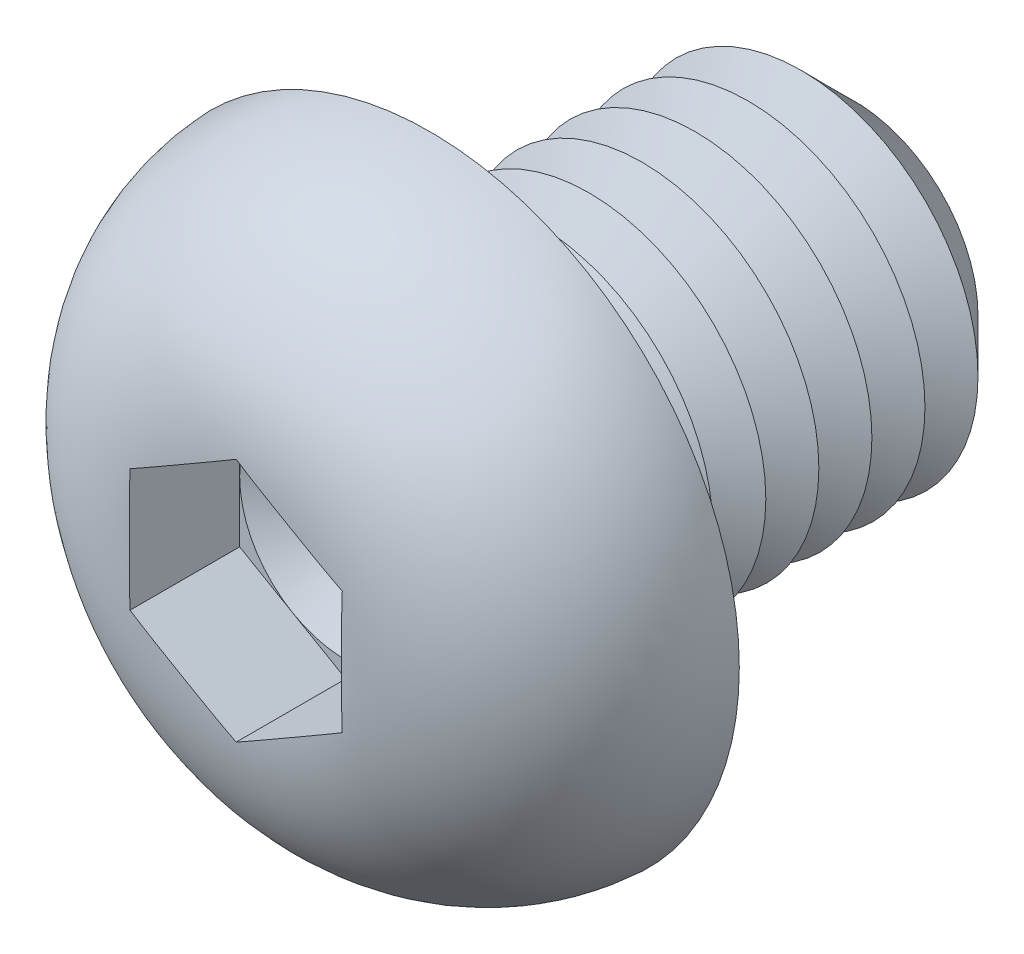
ISO-10303-21;
HEADER;
FILE_DESCRIPTION(('STEP AP214'),'2;1');
FILE_NAME('part.step','',(''),(''),'','','');
FILE_SCHEMA(('AUTOMOTIVE_DESIGN { 1 0 10303 214 1 1 1 1 }'));
ENDSEC;
DATA;
#1=APPLICATION_CONTEXT('core data for automotive mechanical design processes');
#2=APPLICATION_PROTOCOL_DEFINITION('international standard','automotive_design',2000,#1);
#3=PRODUCT_CONTEXT('',#1,'mechanical');
#4=PRODUCT('Part','Part','',(#3));
#5=PRODUCT_RELATED_PRODUCT_CATEGORY('part','',(#4));
#6=PRODUCT_DEFINITION_FORMATION('','',#4);
#7=PRODUCT_DEFINITION_CONTEXT('part definition',#1,'design');
#8=PRODUCT_DEFINITION('design','',#6,#7);
#9=PRODUCT_DEFINITION_SHAPE('','',#8);
#10=(LENGTH_UNIT() NAMED_UNIT(*) SI_UNIT(.MILLI.,.METRE.));
#11=(NAMED_UNIT(*) PLANE_ANGLE_UNIT() SI_UNIT($,.RADIAN.));
#12=(NAMED_UNIT(*) SI_UNIT($,.STERADIAN.) SOLID_ANGLE_UNIT());
#13=UNCERTAINTY_MEASURE_WITH_UNIT(LENGTH_MEASURE(1.E-05),#10,'distance_accuracy_value','');
#14=(GEOMETRIC_REPRESENTATION_CONTEXT(3) GLOBAL_UNCERTAINTY_ASSIGNED_CONTEXT((#13)) GLOBAL_UNIT_ASSIGNED_CONTEXT((#10,
#11,#12)) REPRESENTATION_CONTEXT('',''));
#15=CARTESIAN_POINT('',(0.,0.,0.));
#16=DIRECTION('',(0.,0.,1.));
#17=DIRECTION('',(1.,0.,0.));
#18=AXIS2_PLACEMENT_3D('',#15,#16,#17);
#19=CARTESIAN_POINT('',(0.,0.,2.38));
#20=DIRECTION('',(0.,0.,1.));
#21=DIRECTION('',(1.,0.,0.));
#22=AXIS2_PLACEMENT_3D('',#19,#20,#21);
#23=PLANE('',#22);
#24=CARTESIAN_POINT('',(0.,0.,2.38));
#25=DIRECTION('',(0.,0.,1.));
#26=DIRECTION('',(1.,0.,0.));
#27=AXIS2_PLACEMENT_3D('',#24,#25,#26);
#28=CIRCLE('',#27,3.);
#29=CARTESIAN_POINT('',(3.,0.,2.38));
#30=VERTEX_POINT('',#29);
#31=CARTESIAN_POINT('',(1.5,2.59807621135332,2.38));
#32=VERTEX_POINT('',#31);
#33=EDGE_CURVE('E117',#30,#32,#28,.T.);
#34=ORIENTED_EDGE('',*,*,#33,.F.);
#35=DIRECTION('',(0.,1.,0.));
#36=VECTOR('',#35,1.);
#37=CARTESIAN_POINT('',(3.,-1.73205080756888,2.38));
#38=LINE('',#37,#36);
#39=CARTESIAN_POINT('',(3.,1.73205080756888,2.38));
#40=VERTEX_POINT('',#39);
#41=EDGE_CURVE('E140',#30,#40,#38,.T.);
#42=ORIENTED_EDGE('',*,*,#41,.T.);
#43=DIRECTION('',(-0.866025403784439,0.5,0.));
#44=VECTOR('',#43,1.);
#45=CARTESIAN_POINT('',(3.,1.73205080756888,2.38));
#46=LINE('',#45,#44);
#47=EDGE_CURVE('E136',#40,#32,#46,.T.);
#48=ORIENTED_EDGE('',*,*,#47,.T.);
#49=EDGE_LOOP('',(#34,#42,#48));
#50=FACE_BOUND('',#49,.T.);
#51=ADVANCED_FACE('F39',(#50),#23,.T.);
#52=CARTESIAN_POINT('',(0.,0.,2.38));
#53=DIRECTION('',(0.,0.,1.));
#54=DIRECTION('',(1.,0.,0.));
#55=AXIS2_PLACEMENT_3D('',#52,#53,#54);
#56=CIRCLE('',#55,3.);
#57=CARTESIAN_POINT('',(-1.5,2.59807621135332,2.38));
#58=VERTEX_POINT('',#57);
#59=EDGE_CURVE('E11',#32,#58,#56,.T.);
#60=ORIENTED_EDGE('',*,*,#59,.F.);
#61=CARTESIAN_POINT('',(0.,3.46410161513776,2.38));
#62=VERTEX_POINT('',#61);
#63=EDGE_CURVE('E130',#32,#62,#46,.T.);
#64=ORIENTED_EDGE('',*,*,#63,.T.);
#65=DIRECTION('',(-0.866025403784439,-0.5,0.));
#66=VECTOR('',#65,1.);
#67=CARTESIAN_POINT('',(0.,3.46410161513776,2.38));
#68=LINE('',#67,#66);
#69=EDGE_CURVE('E131',#62,#58,#68,.T.);
#70=ORIENTED_EDGE('',*,*,#69,.T.);
#71=EDGE_LOOP('',(#60,#64,#70));
#72=FACE_BOUND('',#71,.T.);
#73=ADVANCED_FACE('F129',(#72),#23,.T.);
#74=CARTESIAN_POINT('',(-3.,0.,2.38));
#75=VERTEX_POINT('',#74);
#76=EDGE_CURVE('E49',#58,#75,#56,.T.);
#77=ORIENTED_EDGE('',*,*,#76,.F.);
#78=CARTESIAN_POINT('',(-3.,1.73205080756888,2.38));
#79=VERTEX_POINT('',#78);
#80=EDGE_CURVE('E143',#58,#79,#68,.T.);
#81=ORIENTED_EDGE('',*,*,#80,.T.);
#82=DIRECTION('',(0.,-1.,0.));
#83=VECTOR('',#82,1.);
#84=CARTESIAN_POINT('',(-3.,1.73205080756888,2.38));
#85=LINE('',#84,#83);
#86=EDGE_CURVE('E153',#79,#75,#85,.T.);
#87=ORIENTED_EDGE('',*,*,#86,.T.);
#88=EDGE_LOOP('',(#77,#81,#87));
#89=FACE_BOUND('',#88,.T.);
#90=ADVANCED_FACE('F268',(#89),#23,.T.);
#91=CARTESIAN_POINT('',(-1.5,-2.59807621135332,2.38));
#92=VERTEX_POINT('',#91);
#93=EDGE_CURVE('E252',#75,#92,#56,.T.);
#94=ORIENTED_EDGE('',*,*,#93,.F.);
#95=CARTESIAN_POINT('',(-3.,-1.73205080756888,2.38));
#96=VERTEX_POINT('',#95);
#97=EDGE_CURVE('E152',#75,#96,#85,.T.);
#98=ORIENTED_EDGE('',*,*,#97,.T.);
#99=DIRECTION('',(0.866025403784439,-0.5,0.));
#100=VECTOR('',#99,1.);
#101=CARTESIAN_POINT('',(-3.,-1.73205080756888,2.38));
#102=LINE('',#101,#100);
#103=EDGE_CURVE('E158',#96,#92,#102,.T.);
#104=ORIENTED_EDGE('',*,*,#103,.T.);
#105=EDGE_LOOP('',(#94,#98,#104));
#106=FACE_BOUND('',#105,.T.);
#107=ADVANCED_FACE('F263',(#106),#23,.T.);
#108=CARTESIAN_POINT('',(1.5,-2.59807621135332,2.38));
#109=VERTEX_POINT('',#108);
#110=EDGE_CURVE('E56',#92,#109,#56,.T.);
#111=ORIENTED_EDGE('',*,*,#110,.F.);
#112=CARTESIAN_POINT('',(0.,-3.46410161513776,2.38));
#113=VERTEX_POINT('',#112);
#114=EDGE_CURVE('E157',#92,#113,#102,.T.);
#115=ORIENTED_EDGE('',*,*,#114,.T.);
#116=DIRECTION('',(0.866025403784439,0.5,0.));
#117=VECTOR('',#116,1.);
#118=CARTESIAN_POINT('',(0.,-3.46410161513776,2.38));
#119=LINE('',#118,#117);
#120=EDGE_CURVE('E163',#113,#109,#119,.T.);
#121=ORIENTED_EDGE('',*,*,#120,.T.);
#122=EDGE_LOOP('',(#111,#115,#121));
#123=FACE_BOUND('',#122,.T.);
#124=ADVANCED_FACE('F304',(#123),#23,.T.);
#125=CARTESIAN_POINT('',(0.,0.,-12.));
#126=DIRECTION('',(0.,0.,1.));
#127=DIRECTION('',(1.,0.,0.));
#128=AXIS2_PLACEMENT_3D('',#125,#126,#127);
#129=CYLINDRICAL_SURFACE('',#128,5.);
#130=CARTESIAN_POINT('',(0.,0.,-0.6));
#131=DIRECTION('',(0.,0.,1.));
#132=DIRECTION('',(1.,0.,0.));
#133=AXIS2_PLACEMENT_3D('',#130,#131,#132);
#134=CIRCLE('',#133,5.);
#135=CARTESIAN_POINT('',(5.,0.,-0.6));
#136=VERTEX_POINT('',#135);
#137=EDGE_CURVE('E242',#136,#136,#134,.F.);
#138=ORIENTED_EDGE('',*,*,#137,.T.);
#139=EDGE_LOOP('',(#138));
#140=FACE_BOUND('',#139,.T.);
#141=CARTESIAN_POINT('',(0.,0.,-1.5));
#142=DIRECTION('',(0.,0.,1.));
#143=DIRECTION('',(1.,0.,0.));
#144=AXIS2_PLACEMENT_3D('',#141,#142,#143);
#145=CIRCLE('',#144,5.00000000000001);
#146=CARTESIAN_POINT('',(5.00000000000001,0.,-1.5));
#147=VERTEX_POINT('',#146);
#148=EDGE_CURVE('E138',#147,#147,#145,.T.);
#149=ORIENTED_EDGE('',*,*,#148,.T.);
#150=EDGE_LOOP('',(#149));
#151=FACE_BOUND('',#150,.T.);
#152=ADVANCED_FACE('F305',(#140,#151),#129,.T.);
#153=CARTESIAN_POINT('',(0.,8.75,0.));
#154=DIRECTION('',(0.,0.,1.));
#155=DIRECTION('',(1.,0.,0.));
#156=AXIS2_PLACEMENT_3D('',#153,#154,#155);
#157=PLANE('',#156);
#158=CARTESIAN_POINT('',(0.,0.,0.));
#159=DIRECTION('',(0.,0.,1.));
#160=DIRECTION('',(1.,0.,0.));
#161=AXIS2_PLACEMENT_3D('',#158,#159,#160);
#162=CIRCLE('',#161,5.6);
#163=CARTESIAN_POINT('',(5.6,0.,0.));
#164=VERTEX_POINT('',#163);
#165=EDGE_CURVE('E245',#164,#164,#162,.T.);
#166=ORIENTED_EDGE('',*,*,#165,.T.);
#167=EDGE_LOOP('',(#166));
#168=FACE_BOUND('',#167,.T.);
#169=CARTESIAN_POINT('',(0.,0.,0.));
#170=DIRECTION('',(0.,0.,1.));
#171=DIRECTION('',(1.,0.,0.));
#172=AXIS2_PLACEMENT_3D('',#169,#170,#171);
#173=CIRCLE('',#172,8.75);
#174=CARTESIAN_POINT('',(8.75,0.,0.));
#175=VERTEX_POINT('',#174);
#176=EDGE_CURVE('E174',#175,#175,#173,.T.);
#177=ORIENTED_EDGE('',*,*,#176,.F.);
#178=EDGE_LOOP('',(#177));
#179=FACE_BOUND('',#178,.T.);
#180=ADVANCED_FACE('F308',(#168,#179),#157,.F.);
#181=CARTESIAN_POINT('',(0.,0.,-0.3));
#182=DIRECTION('',(0.,0.,1.));
#183=DIRECTION('',(1.,0.,0.));
#184=AXIS2_PLACEMENT_3D('',#181,#182,#183);
#185=DEGENERATE_TOROIDAL_SURFACE('',#184,2.95776381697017,5.8,.T.);
#186=CARTESIAN_POINT('',(-3.0002,1.73193533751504,5.47784605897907));
#187=CARTESIAN_POINT('',(-2.87524340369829,1.80407906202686,5.4841525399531));
#188=CARTESIAN_POINT('',(-2.75023731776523,1.87625135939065,5.48853670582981));
#189=CARTESIAN_POINT('',(-2.5001955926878,2.02061301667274,5.49472046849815));
#190=CARTESIAN_POINT('',(-2.37515996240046,2.09280237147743,5.49652051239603));
#191=CARTESIAN_POINT('',(-2.12510741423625,2.23717027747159,5.4987972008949));
#192=CARTESIAN_POINT('',(-2.00009049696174,2.30934882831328,5.49927407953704));
#193=CARTESIAN_POINT('',(-1.75004905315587,2.45371032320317,5.49979859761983));
#194=CARTESIAN_POINT('',(-1.62502452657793,2.52589326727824,5.49984621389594));
#195=CARTESIAN_POINT('',(-1.37497547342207,2.67025915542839,5.49984621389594));
#196=CARTESIAN_POINT('',(-1.24995094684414,2.74244209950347,5.49979859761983));
#197=CARTESIAN_POINT('',(-0.999909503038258,2.88680359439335,5.49927407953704));
#198=CARTESIAN_POINT('',(-0.874892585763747,2.95898214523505,5.4987972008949));
#199=CARTESIAN_POINT('',(-0.624840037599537,3.10335005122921,5.49652051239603));
#200=CARTESIAN_POINT('',(-0.499804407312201,3.1755394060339,5.49472046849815));
#201=CARTESIAN_POINT('',(-0.249762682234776,3.31990106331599,5.48853670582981));
#202=CARTESIAN_POINT('',(-0.124756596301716,3.39207336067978,5.4841525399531));
#203=CARTESIAN_POINT('',(0.000199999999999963,3.46421708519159,5.47784605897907));
#204=B_SPLINE_CURVE_WITH_KNOTS('',3,(#186,#187,#188,#189,#190,#191,#192,#193,#194,#195,#196,
#197,#198,#199,#200,#201,#202,#203),.UNSPECIFIED.,.F.,.F.,(4,2,2,2,2,2,2,2,4),(0.,
0.433225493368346,0.866376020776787,1.29944992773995,1.73254720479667,2.16564448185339,
2.59871838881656,3.031868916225,3.46509440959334),.UNSPECIFIED.);
#205=CARTESIAN_POINT('',(-3.,1.73205080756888,5.4778561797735));
#206=VERTEX_POINT('',#205);
#207=CARTESIAN_POINT('',(0.,3.46410161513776,5.4778561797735));
#208=VERTEX_POINT('',#207);
#209=EDGE_CURVE('E196',#206,#208,#204,.T.);
#210=ORIENTED_EDGE('',*,*,#209,.T.);
#211=CARTESIAN_POINT('',(-0.000200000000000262,3.46421708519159,5.47784605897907));
#212=CARTESIAN_POINT('',(0.124756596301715,3.39207336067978,5.4841525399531));
#213=CARTESIAN_POINT('',(0.249762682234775,3.31990106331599,5.48853670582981));
#214=CARTESIAN_POINT('',(0.4998044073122,3.1755394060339,5.49472046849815));
#215=CARTESIAN_POINT('',(0.624840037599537,3.10335005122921,5.49652051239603));
#216=CARTESIAN_POINT('',(0.874892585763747,2.95898214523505,5.4987972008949));
#217=CARTESIAN_POINT('',(0.999909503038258,2.88680359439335,5.49927407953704));
#218=CARTESIAN_POINT('',(1.24995094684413,2.74244209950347,5.49979859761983));
#219=CARTESIAN_POINT('',(1.37497547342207,2.67025915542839,5.49984621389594));
#220=CARTESIAN_POINT('',(1.62502452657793,2.52589326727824,5.49984621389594));
#221=CARTESIAN_POINT('',(1.75004905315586,2.45371032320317,5.49979859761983));
#222=CARTESIAN_POINT('',(2.00009049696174,2.30934882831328,5.49927407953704));
#223=CARTESIAN_POINT('',(2.12510741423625,2.23717027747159,5.4987972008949));
#224=CARTESIAN_POINT('',(2.37515996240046,2.09280237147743,5.49652051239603));
#225=CARTESIAN_POINT('',(2.5001955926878,2.02061301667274,5.49472046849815));
#226=CARTESIAN_POINT('',(2.75023731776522,1.87625135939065,5.48853670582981));
#227=CARTESIAN_POINT('',(2.87524340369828,1.80407906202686,5.4841525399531));
#228=CARTESIAN_POINT('',(3.0002,1.73193533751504,5.47784605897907));
#229=B_SPLINE_CURVE_WITH_KNOTS('',3,(#211,#212,#213,#214,#215,#216,#217,#218,#219,#220,#221,
#222,#223,#224,#225,#226,#227,#228),.UNSPECIFIED.,.F.,.F.,(4,2,2,2,2,2,2,2,4),(0.,
0.433225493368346,0.866376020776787,1.29944992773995,1.73254720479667,2.16564448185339,
2.59871838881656,3.031868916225,3.46509440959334),.UNSPECIFIED.);
#230=CARTESIAN_POINT('',(3.,1.73205080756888,5.47785617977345));
#231=VERTEX_POINT('',#230);
#232=EDGE_CURVE('E225',#208,#231,#229,.T.);
#233=ORIENTED_EDGE('',*,*,#232,.T.);
#234=CARTESIAN_POINT('',(3.,0.,5.49984621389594));
#235=CARTESIAN_POINT('',(3.,-0.125570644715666,5.49984449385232));
#236=CARTESIAN_POINT('',(3.,-0.251141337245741,5.49980426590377));
#237=CARTESIAN_POINT('',(3.,-0.502283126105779,5.499449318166));
#238=CARTESIAN_POINT('',(3.,-0.62785422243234,5.49913459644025));
#239=CARTESIAN_POINT('',(3.,-0.879037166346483,5.49770394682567));
#240=CARTESIAN_POINT('',(3.,-1.00464901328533,5.49658774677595));
#241=CARTESIAN_POINT('',(3.,-1.2558477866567,5.49279605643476));
#242=CARTESIAN_POINT('',(3.,-1.38143471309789,5.49012056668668));
#243=CARTESIAN_POINT('',(3.,-1.7568847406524,5.47847778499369));
#244=CARTESIAN_POINT('',(3.,-2.00667103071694,5.46590367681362));
#245=CARTESIAN_POINT('',(3.,-2.50488375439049,5.42441448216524));
#246=CARTESIAN_POINT('',(3.,-2.75331093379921,5.3955095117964));
#247=CARTESIAN_POINT('',(3.,-3.18719021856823,5.32582626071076));
#248=CARTESIAN_POINT('',(3.,-3.3733635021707,5.28960049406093));
#249=CARTESIAN_POINT('',(3.,-3.74245496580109,5.20330651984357));
#250=CARTESIAN_POINT('',(3.,-3.92537417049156,5.15324275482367));
#251=CARTESIAN_POINT('',(3.,-4.28675502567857,5.03819885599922));
#252=CARTESIAN_POINT('',(3.,-4.46521058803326,4.97319946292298));
#253=CARTESIAN_POINT('',(3.,-4.81576789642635,4.82782766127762));
#254=CARTESIAN_POINT('',(3.,-4.98786985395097,4.74745576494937));
#255=CARTESIAN_POINT('',(3.,-5.3254008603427,4.5705398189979));
#256=CARTESIAN_POINT('',(3.,-5.49076268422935,4.47386710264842));
#257=CARTESIAN_POINT('',(3.,-5.81151175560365,4.26514040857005));
#258=CARTESIAN_POINT('',(3.,-5.96689840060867,4.15308550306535));
#259=CARTESIAN_POINT('',(3.,-6.26591787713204,3.91428862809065));
#260=CARTESIAN_POINT('',(3.,-6.40955257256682,3.78754899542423));
#261=CARTESIAN_POINT('',(3.,-6.68342295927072,3.52034797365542));
#262=CARTESIAN_POINT('',(3.,-6.81366070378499,3.3798886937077));
#263=CARTESIAN_POINT('',(3.,-7.0426666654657,3.10626157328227));
#264=CARTESIAN_POINT('',(3.,-7.1433109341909,2.97465879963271));
#265=CARTESIAN_POINT('',(3.,-7.33253056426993,2.70304716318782));
#266=CARTESIAN_POINT('',(3.,-7.42110686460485,2.56303895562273));
#267=CARTESIAN_POINT('',(3.,-7.58534868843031,2.27573732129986));
#268=CARTESIAN_POINT('',(3.,-7.66102067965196,2.12844759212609));
#269=CARTESIAN_POINT('',(3.,-7.79881901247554,1.82765987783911));
#270=CARTESIAN_POINT('',(3.,-7.86094563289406,1.67416202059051));
#271=CARTESIAN_POINT('',(3.,-7.96803488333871,1.37082076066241));
#272=CARTESIAN_POINT('',(3.,-8.01375687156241,1.22124490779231));
#273=CARTESIAN_POINT('',(3.,-8.09224398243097,0.918674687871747));
#274=CARTESIAN_POINT('',(3.,-8.12500479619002,0.765679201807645));
#275=CARTESIAN_POINT('',(3.,-8.17726457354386,0.457507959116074));
#276=CARTESIAN_POINT('',(3.,-8.1967692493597,0.302333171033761));
#277=CARTESIAN_POINT('',(3.,-8.22238322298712,-0.00917738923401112));
#278=CARTESIAN_POINT('',(3.,-8.22848754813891,-0.165513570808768));
#279=CARTESIAN_POINT('',(3.,-8.22724693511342,-0.475358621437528));
#280=CARTESIAN_POINT('',(3.,-8.2201384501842,-0.628868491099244));
#281=CARTESIAN_POINT('',(3.,-8.1929851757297,-0.934809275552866));
#282=CARTESIAN_POINT('',(3.,-8.17293462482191,-1.0872396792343));
#283=CARTESIAN_POINT('',(3.,-8.1200547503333,-1.38984943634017));
#284=CARTESIAN_POINT('',(3.,-8.08722683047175,-1.54002903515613));
#285=CARTESIAN_POINT('',(3.,-8.0090712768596,-1.83702738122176));
#286=CARTESIAN_POINT('',(3.,-7.96374919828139,-1.98384759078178));
#287=CARTESIAN_POINT('',(3.,-7.86096457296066,-2.27315566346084));
#288=CARTESIAN_POINT('',(3.,-7.80350334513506,-2.41564399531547));
#289=CARTESIAN_POINT('',(3.,-7.67691451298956,-2.6952770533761));
#290=CARTESIAN_POINT('',(3.,-7.60779108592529,-2.83242367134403));
#291=CARTESIAN_POINT('',(3.,-7.45837210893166,-3.10056990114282));
#292=CARTESIAN_POINT('',(3.,-7.37807144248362,-3.23156666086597));
#293=CARTESIAN_POINT('',(3.,-7.20697634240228,-3.48645411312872));
#294=CARTESIAN_POINT('',(3.,-7.11618520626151,-3.61034702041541));
#295=CARTESIAN_POINT('',(3.,-6.92334779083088,-3.85210954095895));
#296=CARTESIAN_POINT('',(3.,-6.82115263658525,-3.96986038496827));
#297=CARTESIAN_POINT('',(3.,-6.60745266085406,-4.19658717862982));
#298=CARTESIAN_POINT('',(3.,-6.49594754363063,-4.30556284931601));
#299=CARTESIAN_POINT('',(3.,-6.26450055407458,-4.51413072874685));
#300=CARTESIAN_POINT('',(3.,-6.14455919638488,-4.61372350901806));
#301=CARTESIAN_POINT('',(3.,-5.8971402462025,-4.80306090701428));
#302=CARTESIAN_POINT('',(3.,-5.76966228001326,-4.89280503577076));
#303=CARTESIAN_POINT('',(3.,-5.50268934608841,-5.06561354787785));
#304=CARTESIAN_POINT('',(3.,-5.36291526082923,-5.14824654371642));
#305=CARTESIAN_POINT('',(3.,-5.07726499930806,-5.30226841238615));
#306=CARTESIAN_POINT('',(3.,-4.93138704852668,-5.37365398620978));
#307=CARTESIAN_POINT('',(3.,-4.63484455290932,-5.50505544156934));
#308=CARTESIAN_POINT('',(3.,-4.48418671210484,-5.56508649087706));
#309=CARTESIAN_POINT('',(3.,-4.17906596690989,-5.6740700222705));
#310=CARTESIAN_POINT('',(3.,-4.02460600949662,-5.72303080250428));
#311=CARTESIAN_POINT('',(3.,-3.6739247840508,-5.82125760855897));
#312=CARTESIAN_POINT('',(3.,-3.47687521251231,-5.86756841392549));
#313=CARTESIAN_POINT('',(3.,-3.07981530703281,-5.94521593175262));
#314=CARTESIAN_POINT('',(3.,-2.87980357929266,-5.97654534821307));
#315=CARTESIAN_POINT('',(3.,-2.47751859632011,-6.02656554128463));
#316=CARTESIAN_POINT('',(3.,-2.27523974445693,-6.0452096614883));
#317=CARTESIAN_POINT('',(3.,-1.8700786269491,-6.07274849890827));
#318=CARTESIAN_POINT('',(3.,-1.66719636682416,-6.08164330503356));
#319=CARTESIAN_POINT('',(3.,-1.25887867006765,-6.09343726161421));
#320=CARTESIAN_POINT('',(3.,-1.05344157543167,-6.09626381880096));
#321=CARTESIAN_POINT('',(3.,-0.745285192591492,-6.0985660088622));
#322=CARTESIAN_POINT('',(3.,-0.642567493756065,-6.09901047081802));
#323=CARTESIAN_POINT('',(3.,-0.437131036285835,-6.09957976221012));
#324=CARTESIAN_POINT('',(3.,-0.334412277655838,-6.09970459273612));
#325=CARTESIAN_POINT('',(3.,-0.129132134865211,-6.09984385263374));
#326=CARTESIAN_POINT('',(3.,-0.0265707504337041,-6.09985845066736));
#327=CARTESIAN_POINT('',(3.,0.178552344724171,-6.09981980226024));
#328=CARTESIAN_POINT('',(3.,0.281114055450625,-6.09976655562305));
#329=CARTESIAN_POINT('',(3.,0.486235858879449,-6.09946703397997));
#330=CARTESIAN_POINT('',(3.,0.588795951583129,-6.0992207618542));
#331=CARTESIAN_POINT('',(3.,0.793913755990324,-6.09826017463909));
#332=CARTESIAN_POINT('',(3.,0.896471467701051,-6.097545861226));
#333=CARTESIAN_POINT('',(3.,1.11088851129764,-6.0951586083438));
#334=CARTESIAN_POINT('',(3.,1.22274716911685,-6.0934045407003));
#335=CARTESIAN_POINT('',(3.,1.44642575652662,-6.08829151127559));
#336=CARTESIAN_POINT('',(3.,1.55824568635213,-6.08493255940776));
#337=CARTESIAN_POINT('',(3.,1.89360474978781,-6.07150074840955));
#338=CARTESIAN_POINT('',(3.,2.11703989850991,-6.05807293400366));
#339=CARTESIAN_POINT('',(3.,2.56083256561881,-6.01778675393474));
#340=CARTESIAN_POINT('',(3.,2.78120000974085,-5.99104517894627));
#341=CARTESIAN_POINT('',(3.,3.2192866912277,-5.92065658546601));
#342=CARTESIAN_POINT('',(3.,3.43700630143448,-5.8770119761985));
#343=CARTESIAN_POINT('',(3.,3.82666678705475,-5.78060449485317));
#344=CARTESIAN_POINT('',(3.,3.99942726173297,-5.73116262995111));
#345=CARTESIAN_POINT('',(3.,4.3405567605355,-5.61888897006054));
#346=CARTESIAN_POINT('',(3.,4.50892617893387,-5.55605838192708));
#347=CARTESIAN_POINT('',(3.,4.84049143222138,-5.41635874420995));
#348=CARTESIAN_POINT('',(3.,5.00366586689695,-5.33943871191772));
#349=CARTESIAN_POINT('',(3.,5.32271829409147,-5.17167128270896));
#350=CARTESIAN_POINT('',(3.,5.47859600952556,-5.0808233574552));
#351=CARTESIAN_POINT('',(3.,5.7822829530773,-4.88500135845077));
#352=CARTESIAN_POINT('',(3.,5.93005015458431,-4.77996197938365));
#353=CARTESIAN_POINT('',(3.,6.21523046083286,-4.55663689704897));
#354=CARTESIAN_POINT('',(3.,6.35264336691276,-4.43835093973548));
#355=CARTESIAN_POINT('',(3.,6.61552762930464,-4.18948618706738));
#356=CARTESIAN_POINT('',(3.,6.74101380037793,-4.05892305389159));
#357=CARTESIAN_POINT('',(3.,6.97891308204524,-3.78639059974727));
#358=CARTESIAN_POINT('',(3.,7.09132750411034,-3.64442242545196));
#359=CARTESIAN_POINT('',(3.,7.29113623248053,-3.36530209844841));
#360=CARTESIAN_POINT('',(3.,7.37991316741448,-3.22913733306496));
#361=CARTESIAN_POINT('',(3.,7.5451968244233,-2.94955428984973));
#362=CARTESIAN_POINT('',(3.,7.62170419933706,-2.80613639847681));
#363=CARTESIAN_POINT('',(3.,7.76177641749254,-2.5131168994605));
#364=CARTESIAN_POINT('',(3.,7.82534152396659,-2.36351541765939));
#365=CARTESIAN_POINT('',(3.,7.93897019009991,-2.05926799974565));
#366=CARTESIAN_POINT('',(3.,7.98903395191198,-1.9046221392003));
#367=CARTESIAN_POINT('',(3.,8.07336540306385,-1.59821781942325));
#368=CARTESIAN_POINT('',(3.,8.10821878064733,-1.44662026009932));
#369=CARTESIAN_POINT('',(3.,8.16487862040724,-1.14095089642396));
#370=CARTESIAN_POINT('',(3.,8.18668070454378,-0.986878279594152));
#371=CARTESIAN_POINT('',(3.,8.21703234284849,-0.677515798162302));
#372=CARTESIAN_POINT('',(3.,8.22558889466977,-0.522226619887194));
#373=CARTESIAN_POINT('',(3.,8.22940229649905,-0.211427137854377));
#374=CARTESIAN_POINT('',(3.,8.22465425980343,-0.0559167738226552));
#375=CARTESIAN_POINT('',(3.,8.20204101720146,0.252033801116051));
#376=CARTESIAN_POINT('',(3.,8.18435378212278,0.404487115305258));
#377=CARTESIAN_POINT('',(3.,8.136196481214,0.707418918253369));
#378=CARTESIAN_POINT('',(3.,8.1057217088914,0.857896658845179));
#379=CARTESIAN_POINT('',(3.,8.03224632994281,1.15569567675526));
#380=CARTESIAN_POINT('',(3.,7.9892508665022,1.30301822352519));
#381=CARTESIAN_POINT('',(3.,7.89104818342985,1.59360769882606));
#382=CARTESIAN_POINT('',(3.,7.83583549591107,1.73687277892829));
#383=CARTESIAN_POINT('',(3.,7.71349498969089,2.01864020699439));
#384=CARTESIAN_POINT('',(3.,7.64633814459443,2.1571299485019));
#385=CARTESIAN_POINT('',(3.,7.50076383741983,2.42797950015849));
#386=CARTESIAN_POINT('',(3.,7.42235122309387,2.56034191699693));
#387=CARTESIAN_POINT('',(3.,7.25483284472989,2.8181715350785));
#388=CARTESIAN_POINT('',(3.,7.16572386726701,2.94363664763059));
#389=CARTESIAN_POINT('',(3.,6.9775559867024,3.1867979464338));
#390=CARTESIAN_POINT('',(3.,6.87850037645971,3.30449668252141));
#391=CARTESIAN_POINT('',(3.,6.66919743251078,3.53363644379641));
#392=CARTESIAN_POINT('',(3.,6.55877281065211,3.6449154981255));
#393=CARTESIAN_POINT('',(3.,6.32925753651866,3.85806320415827));
#394=CARTESIAN_POINT('',(3.,6.21016952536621,3.95993470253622));
#395=CARTESIAN_POINT('',(3.,5.96413069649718,4.15386505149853));
#396=CARTESIAN_POINT('',(3.,5.83717459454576,4.24591719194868));
#397=CARTESIAN_POINT('',(3.,5.5764653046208,4.41973423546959));
#398=CARTESIAN_POINT('',(3.,5.4427139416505,4.50150188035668));
#399=CARTESIAN_POINT('',(3.,5.16249709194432,4.65840017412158));
#400=CARTESIAN_POINT('',(3.,5.01573037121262,4.73299250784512));
#401=CARTESIAN_POINT('',(3.,4.71685583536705,4.87057528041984));
#402=CARTESIAN_POINT('',(3.,4.56474751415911,4.93356461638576));
#403=CARTESIAN_POINT('',(3.,4.25657035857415,5.04801407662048));
#404=CARTESIAN_POINT('',(3.,4.10050882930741,5.09949395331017));
#405=CARTESIAN_POINT('',(3.,3.78523286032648,5.19149003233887));
#406=CARTESIAN_POINT('',(3.,3.62601895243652,5.23200806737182));
#407=CARTESIAN_POINT('',(3.,3.32461902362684,5.29856444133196));
#408=CARTESIAN_POINT('',(3.,3.18268434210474,5.32575733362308));
#409=CARTESIAN_POINT('',(3.,2.89760844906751,5.3729307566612));
#410=CARTESIAN_POINT('',(3.,2.75446703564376,5.39291005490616));
#411=CARTESIAN_POINT('',(3.,2.46730946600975,5.42656527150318));
#412=CARTESIAN_POINT('',(3.,2.32329255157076,5.44023457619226));
#413=CARTESIAN_POINT('',(3.,2.03487642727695,5.46234228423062));
#414=CARTESIAN_POINT('',(3.,1.89047722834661,5.4707808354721));
#415=CARTESIAN_POINT('',(3.,1.60058090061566,5.48373897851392));
#416=CARTESIAN_POINT('',(3.,1.45508270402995,5.48823290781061));
#417=CARTESIAN_POINT('',(3.,1.16402671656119,5.49458098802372));
#418=CARTESIAN_POINT('',(3.,1.01846892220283,5.49643495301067));
#419=CARTESIAN_POINT('',(3.,0.72742451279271,5.49877506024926));
#420=CARTESIAN_POINT('',(3.,0.581937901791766,5.49926194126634));
#421=CARTESIAN_POINT('',(3.,0.290967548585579,5.49979850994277));
#422=CARTESIAN_POINT('',(3.,0.145483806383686,5.49984820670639));
#423=CARTESIAN_POINT('',(3.,0.,5.49984621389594));
#424=B_SPLINE_CURVE_WITH_KNOTS('',3,(#234,#235,#236,#237,#238,#239,#240,#241,#242,#243,#244,
#245,#246,#247,#248,#249,#250,#251,#252,#253,#254,#255,#256,#257,#258,#259,#260,#261,#262,#263,
#264,#265,#266,#267,#268,#269,#270,#271,#272,#273,#274,#275,#276,#277,#278,#279,#280,#281,#282,
#283,#284,#285,#286,#287,#288,#289,#290,#291,#292,#293,#294,#295,#296,#297,#298,#299,#300,#301,
#302,#303,#304,#305,#306,#307,#308,#309,#310,#311,#312,#313,#314,#315,#316,#317,#318,#319,#320,
#321,#322,#323,#324,#325,#326,#327,#328,#329,#330,#331,#332,#333,#334,#335,#336,#337,#338,#339,
#340,#341,#342,#343,#344,#345,#346,#347,#348,#349,#350,#351,#352,#353,#354,#355,#356,#357,#358,
#359,#360,#361,#362,#363,#364,#365,#366,#367,#368,#369,#370,#371,#372,#373,#374,#375,#376,#377,
#378,#379,#380,#381,#382,#383,#384,#385,#386,#387,#388,#389,#390,#391,#392,#393,#394,#395,#396,
#397,#398,#399,#400,#401,#402,#403,#404,#405,#406,#407,#408,#409,#410,#411,#412,#413,#414,#415,
#416,#417,#418,#419,#420,#421,#422,#423),.UNSPECIFIED.,.T.,.F.,(4,2,2,2,2,2,2,2,2,2,2,2,2,2,2,2,
2,2,2,2,2,2,2,2,2,2,2,2,2,2,2,2,2,2,2,2,2,2,2,2,2,2,2,2,2,2,2,2,2,2,2,2,2,2,2,2,2,2,2,2,2,2,2,2,
2,2,2,2,2,2,2,2,2,2,2,2,2,2,2,2,2,2,2,2,2,2,2,2,2,2,2,2,2,2,4),(0.,0.376711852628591,
0.753426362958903,1.13026885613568,1.50711121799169,2.257095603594,3.00661592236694,
3.57514719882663,4.14349616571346,4.71258216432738,5.28164920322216,5.85543852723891,
6.42926247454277,7.00299523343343,7.57663992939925,8.07303876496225,8.56939895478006,
9.06550962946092,9.56161009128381,10.030267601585,10.4990807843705,10.9676918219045,
11.4364767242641,11.8969530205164,12.3576344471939,12.8182652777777,13.2786916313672,
13.7390679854,14.1992797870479,14.6597029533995,15.1199817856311,15.5871904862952,
16.0544140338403,16.5216091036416,16.9888273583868,17.4754224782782,17.9621600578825,
18.4482427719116,18.9339599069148,19.5405320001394,20.1473991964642,20.7564865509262,
21.3655683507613,21.9818967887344,22.2900536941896,22.5982095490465,22.905893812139,
23.2135789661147,23.5212595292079,23.8289389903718,24.1645461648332,24.5001512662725,
25.171371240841,25.8368042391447,26.5021424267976,27.0407309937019,27.5792710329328,
28.119799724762,28.660348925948,29.2034761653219,29.7466138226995,30.2890677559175,
30.831467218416,31.3185063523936,31.8055195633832,32.2925228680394,32.779518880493,
33.2456153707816,33.7118681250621,34.1778744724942,34.6440520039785,35.103935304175,
35.563988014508,36.0238520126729,36.4839222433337,36.9451261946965,37.4061321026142,
37.8672768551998,38.3282694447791,38.7980460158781,39.2676799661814,39.7376328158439,
40.207460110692,40.7008436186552,41.1942739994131,41.6868509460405,42.1793454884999,
42.6126940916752,43.0461167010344,43.479992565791,43.9138561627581,44.3505218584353,
44.7872183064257,45.2236787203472,45.6601300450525),.UNSPECIFIED.);
#425=CARTESIAN_POINT('',(3.,-1.73205080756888,5.4778561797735));
#426=VERTEX_POINT('',#425);
#427=EDGE_CURVE('E234',#231,#426,#424,.T.);
#428=ORIENTED_EDGE('',*,*,#427,.T.);
#429=CARTESIAN_POINT('',(3.0002,-1.73193533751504,5.47784605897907));
#430=CARTESIAN_POINT('',(2.87524340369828,-1.80407906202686,5.4841525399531));
#431=CARTESIAN_POINT('',(2.75023731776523,-1.87625135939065,5.48853670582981));
#432=CARTESIAN_POINT('',(2.5001955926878,-2.02061301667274,5.49472046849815));
#433=CARTESIAN_POINT('',(2.37515996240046,-2.09280237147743,5.49652051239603));
#434=CARTESIAN_POINT('',(2.12510741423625,-2.23717027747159,5.4987972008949));
#435=CARTESIAN_POINT('',(2.00009049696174,-2.30934882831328,5.49927407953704));
#436=CARTESIAN_POINT('',(1.75004905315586,-2.45371032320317,5.49979859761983));
#437=CARTESIAN_POINT('',(1.62502452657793,-2.52589326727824,5.49984621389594));
#438=CARTESIAN_POINT('',(1.37497547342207,-2.67025915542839,5.49984621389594));
#439=CARTESIAN_POINT('',(1.24995094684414,-2.74244209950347,5.49979859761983));
#440=CARTESIAN_POINT('',(0.999909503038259,-2.88680359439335,5.49927407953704));
#441=CARTESIAN_POINT('',(0.874892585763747,-2.95898214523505,5.4987972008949));
#442=CARTESIAN_POINT('',(0.624840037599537,-3.10335005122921,5.49652051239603));
#443=CARTESIAN_POINT('',(0.499804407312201,-3.1755394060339,5.49472046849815));
#444=CARTESIAN_POINT('',(0.249762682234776,-3.31990106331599,5.48853670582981));
#445=CARTESIAN_POINT('',(0.124756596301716,-3.39207336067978,5.4841525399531));
#446=CARTESIAN_POINT('',(-0.000199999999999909,-3.46421708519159,5.47784605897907));
#447=B_SPLINE_CURVE_WITH_KNOTS('',3,(#429,#430,#431,#432,#433,#434,#435,#436,#437,#438,#439,
#440,#441,#442,#443,#444,#445,#446),.UNSPECIFIED.,.F.,.F.,(4,2,2,2,2,2,2,2,4),(0.,
0.433225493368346,0.866376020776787,1.29944992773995,1.73254720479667,2.16564448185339,
2.59871838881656,3.031868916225,3.46509440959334),.UNSPECIFIED.);
#448=CARTESIAN_POINT('',(0.,-3.46410161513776,5.4778561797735));
#449=VERTEX_POINT('',#448);
#450=EDGE_CURVE('E278',#426,#449,#447,.T.);
#451=ORIENTED_EDGE('',*,*,#450,.T.);
#452=CARTESIAN_POINT('',(0.000200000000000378,-3.46421708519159,5.47784605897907));
#453=CARTESIAN_POINT('',(-0.124756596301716,-3.39207336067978,5.4841525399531));
#454=CARTESIAN_POINT('',(-0.249762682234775,-3.31990106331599,5.48853670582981));
#455=CARTESIAN_POINT('',(-0.499804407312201,-3.1755394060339,5.49472046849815));
#456=CARTESIAN_POINT('',(-0.624840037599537,-3.10335005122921,5.49652051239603));
#457=CARTESIAN_POINT('',(-0.874892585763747,-2.95898214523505,5.4987972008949));
#458=CARTESIAN_POINT('',(-0.999909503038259,-2.88680359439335,5.49927407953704));
#459=CARTESIAN_POINT('',(-1.24995094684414,-2.74244209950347,5.49979859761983));
#460=CARTESIAN_POINT('',(-1.37497547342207,-2.67025915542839,5.49984621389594));
#461=CARTESIAN_POINT('',(-1.62502452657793,-2.52589326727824,5.49984621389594));
#462=CARTESIAN_POINT('',(-1.75004905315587,-2.45371032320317,5.49979859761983));
#463=CARTESIAN_POINT('',(-2.00009049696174,-2.30934882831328,5.49927407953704));
#464=CARTESIAN_POINT('',(-2.12510741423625,-2.23717027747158,5.4987972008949));
#465=CARTESIAN_POINT('',(-2.37515996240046,-2.09280237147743,5.49652051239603));
#466=CARTESIAN_POINT('',(-2.5001955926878,-2.02061301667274,5.49472046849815));
#467=CARTESIAN_POINT('',(-2.75023731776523,-1.87625135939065,5.48853670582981));
#468=CARTESIAN_POINT('',(-2.87524340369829,-1.80407906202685,5.4841525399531));
#469=CARTESIAN_POINT('',(-3.0002,-1.73193533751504,5.47784605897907));
#470=B_SPLINE_CURVE_WITH_KNOTS('',3,(#452,#453,#454,#455,#456,#457,#458,#459,#460,#461,#462,
#463,#464,#465,#466,#467,#468,#469),.UNSPECIFIED.,.F.,.F.,(4,2,2,2,2,2,2,2,4),(0.,
0.433225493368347,0.866376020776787,1.29944992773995,1.73254720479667,2.16564448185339,
2.59871838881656,3.031868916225,3.46509440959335),.UNSPECIFIED.);
#471=CARTESIAN_POINT('',(-3.,-1.73205080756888,5.47785617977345));
#472=VERTEX_POINT('',#471);
#473=EDGE_CURVE('E275',#449,#472,#470,.T.);
#474=ORIENTED_EDGE('',*,*,#473,.T.);
#475=CARTESIAN_POINT('',(-3.,0.,5.49984621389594));
#476=CARTESIAN_POINT('',(-3.,0.125570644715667,5.49984449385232));
#477=CARTESIAN_POINT('',(-3.,0.251141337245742,5.49980426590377));
#478=CARTESIAN_POINT('',(-3.,0.50228312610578,5.499449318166));
#479=CARTESIAN_POINT('',(-3.,0.627854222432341,5.49913459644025));
#480=CARTESIAN_POINT('',(-3.,0.879037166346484,5.49770394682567));
#481=CARTESIAN_POINT('',(-3.,1.00464901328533,5.49658774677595));
#482=CARTESIAN_POINT('',(-3.,1.2558477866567,5.49279605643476));
#483=CARTESIAN_POINT('',(-3.,1.3814347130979,5.49012056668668));
#484=CARTESIAN_POINT('',(-3.,1.7568847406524,5.47847778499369));
#485=CARTESIAN_POINT('',(-3.,2.00667103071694,5.46590367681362));
#486=CARTESIAN_POINT('',(-3.,2.50488375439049,5.42441448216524));
#487=CARTESIAN_POINT('',(-3.,2.75331093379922,5.3955095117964));
#488=CARTESIAN_POINT('',(-3.,3.18719021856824,5.32582626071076));
#489=CARTESIAN_POINT('',(-3.,3.3733635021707,5.28960049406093));
#490=CARTESIAN_POINT('',(-3.,3.74245496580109,5.20330651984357));
#491=CARTESIAN_POINT('',(-3.,3.92537417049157,5.15324275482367));
#492=CARTESIAN_POINT('',(-3.,4.28675502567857,5.03819885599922));
#493=CARTESIAN_POINT('',(-3.,4.46521058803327,4.97319946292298));
#494=CARTESIAN_POINT('',(-3.,4.81576789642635,4.82782766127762));
#495=CARTESIAN_POINT('',(-3.,4.98786985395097,4.74745576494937));
#496=CARTESIAN_POINT('',(-3.,5.3254008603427,4.5705398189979));
#497=CARTESIAN_POINT('',(-3.,5.49076268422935,4.47386710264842));
#498=CARTESIAN_POINT('',(-3.,5.81151175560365,4.26514040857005));
#499=CARTESIAN_POINT('',(-3.,5.96689840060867,4.15308550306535));
#500=CARTESIAN_POINT('',(-3.,6.26591787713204,3.91428862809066));
#501=CARTESIAN_POINT('',(-3.,6.40955257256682,3.78754899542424));
#502=CARTESIAN_POINT('',(-3.,6.68342295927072,3.52034797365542));
#503=CARTESIAN_POINT('',(-3.,6.81366070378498,3.3798886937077));
#504=CARTESIAN_POINT('',(-3.,7.0426666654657,3.10626157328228));
#505=CARTESIAN_POINT('',(-3.,7.14331093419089,2.97465879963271));
#506=CARTESIAN_POINT('',(-3.,7.33253056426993,2.70304716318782));
#507=CARTESIAN_POINT('',(-3.,7.42110686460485,2.56303895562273));
#508=CARTESIAN_POINT('',(-3.,7.58534868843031,2.27573732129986));
#509=CARTESIAN_POINT('',(-3.,7.66102067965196,2.12844759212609));
#510=CARTESIAN_POINT('',(-3.,7.79881901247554,1.82765987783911));
#511=CARTESIAN_POINT('',(-3.,7.86094563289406,1.67416202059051));
#512=CARTESIAN_POINT('',(-3.,7.96803488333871,1.37082076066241));
#513=CARTESIAN_POINT('',(-3.,8.01375687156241,1.22124490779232));
#514=CARTESIAN_POINT('',(-3.,8.09224398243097,0.918674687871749));
#515=CARTESIAN_POINT('',(-3.,8.12500479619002,0.765679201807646));
#516=CARTESIAN_POINT('',(-3.,8.17726457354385,0.457507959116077));
#517=CARTESIAN_POINT('',(-3.,8.1967692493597,0.302333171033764));
#518=CARTESIAN_POINT('',(-3.,8.22238322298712,-0.00917738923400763));
#519=CARTESIAN_POINT('',(-3.,8.22848754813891,-0.165513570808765));
#520=CARTESIAN_POINT('',(-3.,8.22724693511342,-0.475358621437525));
#521=CARTESIAN_POINT('',(-3.,8.2201384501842,-0.628868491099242));
#522=CARTESIAN_POINT('',(-3.,8.1929851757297,-0.934809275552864));
#523=CARTESIAN_POINT('',(-3.,8.17293462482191,-1.08723967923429));
#524=CARTESIAN_POINT('',(-3.,8.1200547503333,-1.38984943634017));
#525=CARTESIAN_POINT('',(-3.,8.08722683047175,-1.54002903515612));
#526=CARTESIAN_POINT('',(-3.,8.0090712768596,-1.83702738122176));
#527=CARTESIAN_POINT('',(-3.,7.96374919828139,-1.98384759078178));
#528=CARTESIAN_POINT('',(-3.,7.86096457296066,-2.27315566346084));
#529=CARTESIAN_POINT('',(-3.,7.80350334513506,-2.41564399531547));
#530=CARTESIAN_POINT('',(-3.,7.67691451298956,-2.69527705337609));
#531=CARTESIAN_POINT('',(-3.,7.60779108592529,-2.83242367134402));
#532=CARTESIAN_POINT('',(-3.,7.45837210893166,-3.10056990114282));
#533=CARTESIAN_POINT('',(-3.,7.37807144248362,-3.23156666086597));
#534=CARTESIAN_POINT('',(-3.,7.20697634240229,-3.48645411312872));
#535=CARTESIAN_POINT('',(-3.,7.11618520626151,-3.61034702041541));
#536=CARTESIAN_POINT('',(-3.,6.92334779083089,-3.85210954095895));
#537=CARTESIAN_POINT('',(-3.,6.82115263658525,-3.96986038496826));
#538=CARTESIAN_POINT('',(-3.,6.60745266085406,-4.19658717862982));
#539=CARTESIAN_POINT('',(-3.,6.49594754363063,-4.30556284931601));
#540=CARTESIAN_POINT('',(-3.,6.26450055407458,-4.51413072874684));
#541=CARTESIAN_POINT('',(-3.,6.14455919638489,-4.61372350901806));
#542=CARTESIAN_POINT('',(-3.,5.8971402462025,-4.80306090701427));
#543=CARTESIAN_POINT('',(-3.,5.76966228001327,-4.89280503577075));
#544=CARTESIAN_POINT('',(-3.,5.50268934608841,-5.06561354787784));
#545=CARTESIAN_POINT('',(-3.,5.36291526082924,-5.14824654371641));
#546=CARTESIAN_POINT('',(-3.,5.07726499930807,-5.30226841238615));
#547=CARTESIAN_POINT('',(-3.,4.93138704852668,-5.37365398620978));
#548=CARTESIAN_POINT('',(-3.,4.63484455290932,-5.50505544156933));
#549=CARTESIAN_POINT('',(-3.,4.48418671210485,-5.56508649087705));
#550=CARTESIAN_POINT('',(-3.,4.17906596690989,-5.6740700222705));
#551=CARTESIAN_POINT('',(-3.,4.02460600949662,-5.72303080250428));
#552=CARTESIAN_POINT('',(-3.,3.6739247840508,-5.82125760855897));
#553=CARTESIAN_POINT('',(-3.,3.47687521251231,-5.86756841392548));
#554=CARTESIAN_POINT('',(-3.,3.07981530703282,-5.94521593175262));
#555=CARTESIAN_POINT('',(-3.,2.87980357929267,-5.97654534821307));
#556=CARTESIAN_POINT('',(-3.,2.47751859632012,-6.02656554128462));
#557=CARTESIAN_POINT('',(-3.,2.27523974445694,-6.0452096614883));
#558=CARTESIAN_POINT('',(-3.,1.87007862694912,-6.07274849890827));
#559=CARTESIAN_POINT('',(-3.,1.66719636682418,-6.08164330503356));
#560=CARTESIAN_POINT('',(-3.,1.25887867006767,-6.09343726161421));
#561=CARTESIAN_POINT('',(-3.,1.05344157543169,-6.09626381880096));
#562=CARTESIAN_POINT('',(-3.,0.745285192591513,-6.0985660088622));
#563=CARTESIAN_POINT('',(-3.,0.642567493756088,-6.09901047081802));
#564=CARTESIAN_POINT('',(-3.,0.437131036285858,-6.09957976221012));
#565=CARTESIAN_POINT('',(-3.,0.334412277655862,-6.09970459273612));
#566=CARTESIAN_POINT('',(-3.,0.129132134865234,-6.09984385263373));
#567=CARTESIAN_POINT('',(-3.,0.0265707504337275,-6.09985845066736));
#568=CARTESIAN_POINT('',(-3.,-0.178552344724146,-6.09981980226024));
#569=CARTESIAN_POINT('',(-3.,-0.281114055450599,-6.09976655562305));
#570=CARTESIAN_POINT('',(-3.,-0.486235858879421,-6.09946703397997));
#571=CARTESIAN_POINT('',(-3.,-0.588795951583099,-6.0992207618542));
#572=CARTESIAN_POINT('',(-3.,-0.793913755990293,-6.09826017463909));
#573=CARTESIAN_POINT('',(-3.,-0.89647146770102,-6.097545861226));
#574=CARTESIAN_POINT('',(-3.,-1.11088851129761,-6.0951586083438));
#575=CARTESIAN_POINT('',(-3.,-1.22274716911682,-6.0934045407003));
#576=CARTESIAN_POINT('',(-3.,-1.44642575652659,-6.08829151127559));
#577=CARTESIAN_POINT('',(-3.,-1.55824568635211,-6.08493255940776));
#578=CARTESIAN_POINT('',(-3.,-1.89360474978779,-6.07150074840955));
#579=CARTESIAN_POINT('',(-3.,-2.11703989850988,-6.05807293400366));
#580=CARTESIAN_POINT('',(-3.,-2.56083256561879,-6.01778675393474));
#581=CARTESIAN_POINT('',(-3.,-2.78120000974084,-5.99104517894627));
#582=CARTESIAN_POINT('',(-3.,-3.21928669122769,-5.92065658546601));
#583=CARTESIAN_POINT('',(-3.,-3.43700630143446,-5.8770119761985));
#584=CARTESIAN_POINT('',(-3.,-3.82666678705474,-5.78060449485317));
#585=CARTESIAN_POINT('',(-3.,-3.99942726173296,-5.73116262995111));
#586=CARTESIAN_POINT('',(-3.,-4.34055676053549,-5.61888897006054));
#587=CARTESIAN_POINT('',(-3.,-4.50892617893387,-5.55605838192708));
#588=CARTESIAN_POINT('',(-3.,-4.84049143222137,-5.41635874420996));
#589=CARTESIAN_POINT('',(-3.,-5.00366586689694,-5.33943871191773));
#590=CARTESIAN_POINT('',(-3.,-5.32271829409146,-5.17167128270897));
#591=CARTESIAN_POINT('',(-3.,-5.47859600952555,-5.08082335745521));
#592=CARTESIAN_POINT('',(-3.,-5.78228295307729,-4.88500135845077));
#593=CARTESIAN_POINT('',(-3.,-5.9300501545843,-4.77996197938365));
#594=CARTESIAN_POINT('',(-3.,-6.21523046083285,-4.55663689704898));
#595=CARTESIAN_POINT('',(-3.,-6.35264336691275,-4.43835093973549));
#596=CARTESIAN_POINT('',(-3.,-6.61552762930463,-4.18948618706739));
#597=CARTESIAN_POINT('',(-3.,-6.74101380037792,-4.05892305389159));
#598=CARTESIAN_POINT('',(-3.,-6.97891308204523,-3.78639059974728));
#599=CARTESIAN_POINT('',(-3.,-7.09132750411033,-3.64442242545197));
#600=CARTESIAN_POINT('',(-3.,-7.29113623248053,-3.36530209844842));
#601=CARTESIAN_POINT('',(-3.,-7.37991316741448,-3.22913733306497));
#602=CARTESIAN_POINT('',(-3.,-7.54519682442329,-2.94955428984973));
#603=CARTESIAN_POINT('',(-3.,-7.62170419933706,-2.80613639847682));
#604=CARTESIAN_POINT('',(-3.,-7.76177641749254,-2.5131168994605));
#605=CARTESIAN_POINT('',(-3.,-7.82534152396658,-2.3635154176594));
#606=CARTESIAN_POINT('',(-3.,-7.93897019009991,-2.05926799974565));
#607=CARTESIAN_POINT('',(-3.,-7.98903395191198,-1.9046221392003));
#608=CARTESIAN_POINT('',(-3.,-8.07336540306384,-1.59821781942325));
#609=CARTESIAN_POINT('',(-3.,-8.10821878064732,-1.44662026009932));
#610=CARTESIAN_POINT('',(-3.,-8.16487862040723,-1.14095089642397));
#611=CARTESIAN_POINT('',(-3.,-8.18668070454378,-0.986878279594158));
#612=CARTESIAN_POINT('',(-3.,-8.21703234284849,-0.677515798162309));
#613=CARTESIAN_POINT('',(-3.,-8.22558889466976,-0.522226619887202));
#614=CARTESIAN_POINT('',(-3.,-8.22940229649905,-0.211427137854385));
#615=CARTESIAN_POINT('',(-3.,-8.22465425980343,-0.0559167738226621));
#616=CARTESIAN_POINT('',(-3.,-8.20204101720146,0.252033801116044));
#617=CARTESIAN_POINT('',(-3.,-8.18435378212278,0.40448711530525));
#618=CARTESIAN_POINT('',(-3.,-8.136196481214,0.707418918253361));
#619=CARTESIAN_POINT('',(-3.,-8.1057217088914,0.857896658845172));
#620=CARTESIAN_POINT('',(-3.,-8.03224632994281,1.15569567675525));
#621=CARTESIAN_POINT('',(-3.,-7.9892508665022,1.30301822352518));
#622=CARTESIAN_POINT('',(-3.,-7.89104818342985,1.59360769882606));
#623=CARTESIAN_POINT('',(-3.,-7.83583549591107,1.73687277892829));
#624=CARTESIAN_POINT('',(-3.,-7.71349498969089,2.01864020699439));
#625=CARTESIAN_POINT('',(-3.,-7.64633814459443,2.1571299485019));
#626=CARTESIAN_POINT('',(-3.,-7.50076383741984,2.42797950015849));
#627=CARTESIAN_POINT('',(-3.,-7.42235122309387,2.56034191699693));
#628=CARTESIAN_POINT('',(-3.,-7.25483284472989,2.81817153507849));
#629=CARTESIAN_POINT('',(-3.,-7.16572386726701,2.94363664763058));
#630=CARTESIAN_POINT('',(-3.,-6.97755598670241,3.1867979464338));
#631=CARTESIAN_POINT('',(-3.,-6.87850037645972,3.30449668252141));
#632=CARTESIAN_POINT('',(-3.,-6.66919743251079,3.53363644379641));
#633=CARTESIAN_POINT('',(-3.,-6.55877281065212,3.64491549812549));
#634=CARTESIAN_POINT('',(-3.,-6.32925753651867,3.85806320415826));
#635=CARTESIAN_POINT('',(-3.,-6.21016952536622,3.95993470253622));
#636=CARTESIAN_POINT('',(-3.,-5.96413069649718,4.15386505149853));
#637=CARTESIAN_POINT('',(-3.,-5.83717459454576,4.24591719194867));
#638=CARTESIAN_POINT('',(-3.,-5.5764653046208,4.41973423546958));
#639=CARTESIAN_POINT('',(-3.,-5.4427139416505,4.50150188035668));
#640=CARTESIAN_POINT('',(-3.,-5.16249709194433,4.65840017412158));
#641=CARTESIAN_POINT('',(-3.,-5.01573037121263,4.73299250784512));
#642=CARTESIAN_POINT('',(-3.,-4.71685583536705,4.87057528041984));
#643=CARTESIAN_POINT('',(-3.,-4.56474751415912,4.93356461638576));
#644=CARTESIAN_POINT('',(-3.,-4.25657035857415,5.04801407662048));
#645=CARTESIAN_POINT('',(-3.,-4.10050882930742,5.09949395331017));
#646=CARTESIAN_POINT('',(-3.,-3.78523286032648,5.19149003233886));
#647=CARTESIAN_POINT('',(-3.,-3.62601895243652,5.23200806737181));
#648=CARTESIAN_POINT('',(-3.,-3.32461902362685,5.29856444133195));
#649=CARTESIAN_POINT('',(-3.,-3.18268434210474,5.32575733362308));
#650=CARTESIAN_POINT('',(-3.,-2.89760844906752,5.3729307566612));
#651=CARTESIAN_POINT('',(-3.,-2.75446703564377,5.39291005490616));
#652=CARTESIAN_POINT('',(-3.,-2.46730946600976,5.42656527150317));
#653=CARTESIAN_POINT('',(-3.,-2.32329255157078,5.44023457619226));
#654=CARTESIAN_POINT('',(-3.,-2.03487642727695,5.46234228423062));
#655=CARTESIAN_POINT('',(-3.,-1.89047722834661,5.4707808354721));
#656=CARTESIAN_POINT('',(-3.,-1.60058090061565,5.48373897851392));
#657=CARTESIAN_POINT('',(-3.,-1.45508270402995,5.48823290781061));
#658=CARTESIAN_POINT('',(-3.,-1.16402671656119,5.49458098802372));
#659=CARTESIAN_POINT('',(-3.,-1.01846892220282,5.49643495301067));
#660=CARTESIAN_POINT('',(-3.,-0.727424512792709,5.49877506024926));
#661=CARTESIAN_POINT('',(-3.,-0.581937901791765,5.49926194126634));
#662=CARTESIAN_POINT('',(-3.,-0.290967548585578,5.49979850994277));
#663=CARTESIAN_POINT('',(-3.,-0.145483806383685,5.49984820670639));
#664=CARTESIAN_POINT('',(-3.,0.,5.49984621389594));
#665=B_SPLINE_CURVE_WITH_KNOTS('',3,(#475,#476,#477,#478,#479,#480,#481,#482,#483,#484,#485,
#486,#487,#488,#489,#490,#491,#492,#493,#494,#495,#496,#497,#498,#499,#500,#501,#502,#503,#504,
#505,#506,#507,#508,#509,#510,#511,#512,#513,#514,#515,#516,#517,#518,#519,#520,#521,#522,#523,
#524,#525,#526,#527,#528,#529,#530,#531,#532,#533,#534,#535,#536,#537,#538,#539,#540,#541,#542,
#543,#544,#545,#546,#547,#548,#549,#550,#551,#552,#553,#554,#555,#556,#557,#558,#559,#560,#561,
#562,#563,#564,#565,#566,#567,#568,#569,#570,#571,#572,#573,#574,#575,#576,#577,#578,#579,#580,
#581,#582,#583,#584,#585,#586,#587,#588,#589,#590,#591,#592,#593,#594,#595,#596,#597,#598,#599,
#600,#601,#602,#603,#604,#605,#606,#607,#608,#609,#610,#611,#612,#613,#614,#615,#616,#617,#618,
#619,#620,#621,#622,#623,#624,#625,#626,#627,#628,#629,#630,#631,#632,#633,#634,#635,#636,#637,
#638,#639,#640,#641,#642,#643,#644,#645,#646,#647,#648,#649,#650,#651,#652,#653,#654,#655,#656,
#657,#658,#659,#660,#661,#662,#663,#664),.UNSPECIFIED.,.T.,.F.,(4,2,2,2,2,2,2,2,2,2,2,2,2,2,2,2,
2,2,2,2,2,2,2,2,2,2,2,2,2,2,2,2,2,2,2,2,2,2,2,2,2,2,2,2,2,2,2,2,2,2,2,2,2,2,2,2,2,2,2,2,2,2,2,2,
2,2,2,2,2,2,2,2,2,2,2,2,2,2,2,2,2,2,2,2,2,2,2,2,2,2,2,2,2,2,4),(0.,0.376711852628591,
0.753426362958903,1.13026885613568,1.50711121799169,2.257095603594,3.00661592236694,
3.57514719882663,4.14349616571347,4.71258216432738,5.28164920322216,5.85543852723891,
6.42926247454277,7.00299523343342,7.57663992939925,8.07303876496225,8.56939895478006,
9.06550962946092,9.56161009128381,10.030267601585,10.4990807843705,10.9676918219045,
11.4364767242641,11.8969530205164,12.3576344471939,12.8182652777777,13.2786916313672,
13.7390679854,14.1992797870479,14.6597029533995,15.1199817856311,15.5871904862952,
16.0544140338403,16.5216091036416,16.9888273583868,17.4754224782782,17.9621600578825,
18.4482427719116,18.9339599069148,19.5405320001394,20.1473991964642,20.7564865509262,
21.3655683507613,21.9818967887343,22.2900536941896,22.5982095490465,22.905893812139,
23.2135789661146,23.5212595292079,23.8289389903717,24.1645461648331,24.5001512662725,
25.171371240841,25.8368042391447,26.5021424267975,27.0407309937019,27.5792710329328,
28.1197997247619,28.6603489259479,29.2034761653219,29.7466138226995,30.2890677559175,
30.831467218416,31.3185063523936,31.8055195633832,32.2925228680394,32.779518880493,
33.2456153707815,33.711868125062,34.1778744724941,34.6440520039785,35.103935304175,
35.563988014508,36.0238520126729,36.4839222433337,36.9451261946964,37.4061321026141,
37.8672768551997,38.3282694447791,38.798046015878,39.2676799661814,39.7376328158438,
40.207460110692,40.7008436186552,41.194273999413,41.6868509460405,42.1793454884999,
42.6126940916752,43.0461167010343,43.479992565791,43.913856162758,44.3505218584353,
44.7872183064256,45.2236787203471,45.6601300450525),.UNSPECIFIED.);
#666=EDGE_CURVE('E205',#472,#206,#665,.T.);
#667=ORIENTED_EDGE('',*,*,#666,.T.);
#668=EDGE_LOOP('',(#210,#233,#428,#451,#474,#667));
#669=FACE_BOUND('',#668,.T.);
#670=ORIENTED_EDGE('',*,*,#176,.T.);
#671=EDGE_LOOP('',(#670));
#672=FACE_BOUND('',#671,.T.);
#673=ADVANCED_FACE('F210',(#669,#672),#185,.T.);
#674=CARTESIAN_POINT('',(3.,1.73205080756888,2.38));
#675=DIRECTION('',(0.5,0.866025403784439,0.));
#676=DIRECTION('',(-0.866025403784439,0.5,0.));
#677=AXIS2_PLACEMENT_3D('',#674,#675,#676);
#678=PLANE('',#677);
#679=DIRECTION('',(0.,0.,1.));
#680=VECTOR('',#679,1.);
#681=CARTESIAN_POINT('',(0.,3.46410161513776,2.38));
#682=LINE('',#681,#680);
#683=EDGE_CURVE('E64',#62,#208,#682,.T.);
#684=ORIENTED_EDGE('',*,*,#683,.F.);
#685=ORIENTED_EDGE('',*,*,#63,.F.);
#686=ORIENTED_EDGE('',*,*,#47,.F.);
#687=DIRECTION('',(0.,0.,1.));
#688=VECTOR('',#687,1.);
#689=CARTESIAN_POINT('',(3.,1.73205080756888,2.38));
#690=LINE('',#689,#688);
#691=EDGE_CURVE('E171',#40,#231,#690,.T.);
#692=ORIENTED_EDGE('',*,*,#691,.T.);
#693=ORIENTED_EDGE('',*,*,#232,.F.);
#694=EDGE_LOOP('',(#684,#685,#686,#692,#693));
#695=FACE_BOUND('',#694,.T.);
#696=ADVANCED_FACE('F134',(#695),#678,.F.);
#697=CARTESIAN_POINT('',(3.,-1.73205080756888,2.38));
#698=DIRECTION('',(1.,0.,0.));
#699=DIRECTION('',(0.,1.,0.));
#700=AXIS2_PLACEMENT_3D('',#697,#698,#699);
#701=PLANE('',#700);
#702=ORIENTED_EDGE('',*,*,#691,.F.);
#703=ORIENTED_EDGE('',*,*,#41,.F.);
#704=CARTESIAN_POINT('',(3.,-1.73205080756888,2.38));
#705=VERTEX_POINT('',#704);
#706=EDGE_CURVE('E167',#705,#30,#38,.T.);
#707=ORIENTED_EDGE('',*,*,#706,.F.);
#708=DIRECTION('',(0.,0.,1.));
#709=VECTOR('',#708,1.);
#710=CARTESIAN_POINT('',(3.,-1.73205080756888,2.38));
#711=LINE('',#710,#709);
#712=EDGE_CURVE('E175',#705,#426,#711,.T.);
#713=ORIENTED_EDGE('',*,*,#712,.T.);
#714=ORIENTED_EDGE('',*,*,#427,.F.);
#715=EDGE_LOOP('',(#702,#703,#707,#713,#714));
#716=FACE_BOUND('',#715,.T.);
#717=ADVANCED_FACE('F223',(#716),#701,.F.);
#718=CARTESIAN_POINT('',(0.,-3.46410161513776,2.38));
#719=DIRECTION('',(0.5,-0.866025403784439,0.));
#720=DIRECTION('',(0.866025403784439,0.5,0.));
#721=AXIS2_PLACEMENT_3D('',#718,#719,#720);
#722=PLANE('',#721);
#723=ORIENTED_EDGE('',*,*,#712,.F.);
#724=EDGE_CURVE('E162',#109,#705,#119,.T.);
#725=ORIENTED_EDGE('',*,*,#724,.F.);
#726=ORIENTED_EDGE('',*,*,#120,.F.);
#727=DIRECTION('',(0.,0.,1.));
#728=VECTOR('',#727,1.);
#729=CARTESIAN_POINT('',(0.,-3.46410161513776,2.38));
#730=LINE('',#729,#728);
#731=EDGE_CURVE('E179',#113,#449,#730,.T.);
#732=ORIENTED_EDGE('',*,*,#731,.T.);
#733=ORIENTED_EDGE('',*,*,#450,.F.);
#734=EDGE_LOOP('',(#723,#725,#726,#732,#733));
#735=FACE_BOUND('',#734,.T.);
#736=ADVANCED_FACE('F291',(#735),#722,.F.);
#737=CARTESIAN_POINT('',(-3.,-1.73205080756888,2.38));
#738=DIRECTION('',(-0.5,-0.866025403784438,0.));
#739=DIRECTION('',(0.866025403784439,-0.5,0.));
#740=AXIS2_PLACEMENT_3D('',#737,#738,#739);
#741=PLANE('',#740);
#742=ORIENTED_EDGE('',*,*,#731,.F.);
#743=ORIENTED_EDGE('',*,*,#114,.F.);
#744=ORIENTED_EDGE('',*,*,#103,.F.);
#745=DIRECTION('',(0.,0.,1.));
#746=VECTOR('',#745,1.);
#747=CARTESIAN_POINT('',(-3.,-1.73205080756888,2.38));
#748=LINE('',#747,#746);
#749=EDGE_CURVE('E183',#96,#472,#748,.T.);
#750=ORIENTED_EDGE('',*,*,#749,.T.);
#751=ORIENTED_EDGE('',*,*,#473,.F.);
#752=EDGE_LOOP('',(#742,#743,#744,#750,#751));
#753=FACE_BOUND('',#752,.T.);
#754=ADVANCED_FACE('F288',(#753),#741,.F.);
#755=CARTESIAN_POINT('',(-3.,1.73205080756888,2.38));
#756=DIRECTION('',(-1.,0.,0.));
#757=DIRECTION('',(0.,-1.,0.));
#758=AXIS2_PLACEMENT_3D('',#755,#756,#757);
#759=PLANE('',#758);
#760=ORIENTED_EDGE('',*,*,#749,.F.);
#761=ORIENTED_EDGE('',*,*,#97,.F.);
#762=ORIENTED_EDGE('',*,*,#86,.F.);
#763=DIRECTION('',(0.,0.,1.));
#764=VECTOR('',#763,1.);
#765=CARTESIAN_POINT('',(-3.,1.73205080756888,2.38));
#766=LINE('',#765,#764);
#767=EDGE_CURVE('E187',#79,#206,#766,.T.);
#768=ORIENTED_EDGE('',*,*,#767,.T.);
#769=ORIENTED_EDGE('',*,*,#666,.F.);
#770=EDGE_LOOP('',(#760,#761,#762,#768,#769));
#771=FACE_BOUND('',#770,.T.);
#772=ADVANCED_FACE('F218',(#771),#759,.F.);
#773=CARTESIAN_POINT('',(0.,3.46410161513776,2.38));
#774=DIRECTION('',(-0.5,0.866025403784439,0.));
#775=DIRECTION('',(-0.866025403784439,-0.5,0.));
#776=AXIS2_PLACEMENT_3D('',#773,#774,#775);
#777=PLANE('',#776);
#778=ORIENTED_EDGE('',*,*,#767,.F.);
#779=ORIENTED_EDGE('',*,*,#80,.F.);
#780=ORIENTED_EDGE('',*,*,#69,.F.);
#781=ORIENTED_EDGE('',*,*,#683,.T.);
#782=ORIENTED_EDGE('',*,*,#209,.F.);
#783=EDGE_LOOP('',(#778,#779,#780,#781,#782));
#784=FACE_BOUND('',#783,.T.);
#785=ADVANCED_FACE('F214',(#784),#777,.F.);
#786=EDGE_CURVE('E43',#109,#30,#56,.T.);
#787=ORIENTED_EDGE('',*,*,#786,.F.);
#788=ORIENTED_EDGE('',*,*,#724,.T.);
#789=ORIENTED_EDGE('',*,*,#706,.T.);
#790=EDGE_LOOP('',(#787,#788,#789));
#791=FACE_BOUND('',#790,.T.);
#792=ADVANCED_FACE('F217',(#791),#23,.T.);
#793=CARTESIAN_POINT('',(0.,0.,-1.5));
#794=DIRECTION('',(0.,0.,1.));
#795=DIRECTION('',(1.,0.,0.));
#796=AXIS2_PLACEMENT_3D('',#793,#794,#795);
#797=CONICAL_SURFACE('',#796,5.00000000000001,1.0471975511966);
#798=CARTESIAN_POINT('',(0.,0.,-2.25));
#799=DIRECTION('',(0.,0.,1.));
#800=DIRECTION('',(1.,0.,0.));
#801=AXIS2_PLACEMENT_3D('',#798,#799,#800);
#802=CIRCLE('',#801,3.70096189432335);
#803=CARTESIAN_POINT('',(3.70096189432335,0.,-2.25));
#804=VERTEX_POINT('',#803);
#805=EDGE_CURVE('E407',#804,#804,#802,.T.);
#806=ORIENTED_EDGE('',*,*,#805,.T.);
#807=EDGE_LOOP('',(#806));
#808=FACE_BOUND('',#807,.T.);
#809=ORIENTED_EDGE('',*,*,#148,.F.);
#810=EDGE_LOOP('',(#809));
#811=FACE_BOUND('',#810,.T.);
#812=ADVANCED_FACE('F302',(#808,#811),#797,.T.);
#813=CARTESIAN_POINT('',(0.,0.,-2.25));
#814=DIRECTION('',(0.,0.,-1.));
#815=DIRECTION('',(-1.,0.,0.));
#816=AXIS2_PLACEMENT_3D('',#813,#814,#815);
#817=CONICAL_SURFACE('',#816,3.70096189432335,1.0471975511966);
#818=CARTESIAN_POINT('',(0.,0.,-3.));
#819=DIRECTION('',(0.,0.,1.));
#820=DIRECTION('',(1.,0.,0.));
#821=AXIS2_PLACEMENT_3D('',#818,#819,#820);
#822=CIRCLE('',#821,5.00000000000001);
#823=CARTESIAN_POINT('',(5.00000000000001,0.,-3.));
#824=VERTEX_POINT('',#823);
#825=EDGE_CURVE('E402',#824,#824,#822,.T.);
#826=ORIENTED_EDGE('',*,*,#825,.T.);
#827=EDGE_LOOP('',(#826));
#828=FACE_BOUND('',#827,.T.);
#829=ORIENTED_EDGE('',*,*,#805,.F.);
#830=EDGE_LOOP('',(#829));
#831=FACE_BOUND('',#830,.T.);
#832=ADVANCED_FACE('F318',(#828,#831),#817,.T.);
#833=CARTESIAN_POINT('',(0.,0.,-3.));
#834=DIRECTION('',(0.,0.,1.));
#835=DIRECTION('',(1.,0.,0.));
#836=AXIS2_PLACEMENT_3D('',#833,#834,#835);
#837=CONICAL_SURFACE('',#836,5.00000000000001,1.0471975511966);
#838=CARTESIAN_POINT('',(0.,0.,-3.75));
#839=DIRECTION('',(0.,0.,1.));
#840=DIRECTION('',(1.,0.,0.));
#841=AXIS2_PLACEMENT_3D('',#838,#839,#840);
#842=CIRCLE('',#841,3.70096189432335);
#843=CARTESIAN_POINT('',(3.70096189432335,0.,-3.75));
#844=VERTEX_POINT('',#843);
#845=EDGE_CURVE('E400',#844,#844,#842,.T.);
#846=ORIENTED_EDGE('',*,*,#845,.T.);
#847=EDGE_LOOP('',(#846));
#848=FACE_BOUND('',#847,.T.);
#849=ORIENTED_EDGE('',*,*,#825,.F.);
#850=EDGE_LOOP('',(#849));
#851=FACE_BOUND('',#850,.T.);
#852=ADVANCED_FACE('F322',(#848,#851),#837,.T.);
#853=CARTESIAN_POINT('',(0.,0.,-3.75));
#854=DIRECTION('',(0.,0.,-1.));
#855=DIRECTION('',(-1.,0.,0.));
#856=AXIS2_PLACEMENT_3D('',#853,#854,#855);
#857=CONICAL_SURFACE('',#856,3.70096189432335,1.0471975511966);
#858=CARTESIAN_POINT('',(0.,0.,-4.5));
#859=DIRECTION('',(0.,0.,1.));
#860=DIRECTION('',(1.,0.,0.));
#861=AXIS2_PLACEMENT_3D('',#858,#859,#860);
#862=CIRCLE('',#861,5.00000000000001);
#863=CARTESIAN_POINT('',(5.00000000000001,0.,-4.5));
#864=VERTEX_POINT('',#863);
#865=EDGE_CURVE('E398',#864,#864,#862,.T.);
#866=ORIENTED_EDGE('',*,*,#865,.T.);
#867=EDGE_LOOP('',(#866));
#868=FACE_BOUND('',#867,.T.);
#869=ORIENTED_EDGE('',*,*,#845,.F.);
#870=EDGE_LOOP('',(#869));
#871=FACE_BOUND('',#870,.T.);
#872=ADVANCED_FACE('F326',(#868,#871),#857,.T.);
#873=CARTESIAN_POINT('',(0.,0.,-4.5));
#874=DIRECTION('',(0.,0.,1.));
#875=DIRECTION('',(1.,0.,0.));
#876=AXIS2_PLACEMENT_3D('',#873,#874,#875);
#877=CONICAL_SURFACE('',#876,5.00000000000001,1.0471975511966);
#878=CARTESIAN_POINT('',(0.,0.,-5.25));
#879=DIRECTION('',(0.,0.,1.));
#880=DIRECTION('',(1.,0.,0.));
#881=AXIS2_PLACEMENT_3D('',#878,#879,#880);
#882=CIRCLE('',#881,3.70096189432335);
#883=CARTESIAN_POINT('',(3.70096189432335,0.,-5.25));
#884=VERTEX_POINT('',#883);
#885=EDGE_CURVE('E410',#884,#884,#882,.T.);
#886=ORIENTED_EDGE('',*,*,#885,.T.);
#887=EDGE_LOOP('',(#886));
#888=FACE_BOUND('',#887,.T.);
#889=ORIENTED_EDGE('',*,*,#865,.F.);
#890=EDGE_LOOP('',(#889));
#891=FACE_BOUND('',#890,.T.);
#892=ADVANCED_FACE('F330',(#888,#891),#877,.T.);
#893=CARTESIAN_POINT('',(0.,0.,-5.25));
#894=DIRECTION('',(0.,0.,-1.));
#895=DIRECTION('',(-1.,0.,0.));
#896=AXIS2_PLACEMENT_3D('',#893,#894,#895);
#897=CONICAL_SURFACE('',#896,3.70096189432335,1.0471975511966);
#898=CARTESIAN_POINT('',(0.,0.,-6.));
#899=DIRECTION('',(0.,0.,1.));
#900=DIRECTION('',(1.,0.,0.));
#901=AXIS2_PLACEMENT_3D('',#898,#899,#900);
#902=CIRCLE('',#901,5.00000000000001);
#903=CARTESIAN_POINT('',(5.00000000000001,0.,-6.));
#904=VERTEX_POINT('',#903);
#905=EDGE_CURVE('E423',#904,#904,#902,.T.);
#906=ORIENTED_EDGE('',*,*,#905,.T.);
#907=EDGE_LOOP('',(#906));
#908=FACE_BOUND('',#907,.T.);
#909=ORIENTED_EDGE('',*,*,#885,.F.);
#910=EDGE_LOOP('',(#909));
#911=FACE_BOUND('',#910,.T.);
#912=ADVANCED_FACE('F334',(#908,#911),#897,.T.);
#913=CARTESIAN_POINT('',(0.,0.,-6.));
#914=DIRECTION('',(0.,0.,1.));
#915=DIRECTION('',(1.,0.,0.));
#916=AXIS2_PLACEMENT_3D('',#913,#914,#915);
#917=CONICAL_SURFACE('',#916,5.00000000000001,1.0471975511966);
#918=CARTESIAN_POINT('',(0.,0.,-6.75));
#919=DIRECTION('',(0.,0.,1.));
#920=DIRECTION('',(1.,0.,0.));
#921=AXIS2_PLACEMENT_3D('',#918,#919,#920);
#922=CIRCLE('',#921,3.70096189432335);
#923=CARTESIAN_POINT('',(3.70096189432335,0.,-6.75));
#924=VERTEX_POINT('',#923);
#925=EDGE_CURVE('E427',#924,#924,#922,.T.);
#926=ORIENTED_EDGE('',*,*,#925,.T.);
#927=EDGE_LOOP('',(#926));
#928=FACE_BOUND('',#927,.T.);
#929=ORIENTED_EDGE('',*,*,#905,.F.);
#930=EDGE_LOOP('',(#929));
#931=FACE_BOUND('',#930,.T.);
#932=ADVANCED_FACE('F338',(#928,#931),#917,.T.);
#933=CARTESIAN_POINT('',(0.,0.,-6.75));
#934=DIRECTION('',(0.,0.,-1.));
#935=DIRECTION('',(-1.,0.,0.));
#936=AXIS2_PLACEMENT_3D('',#933,#934,#935);
#937=CONICAL_SURFACE('',#936,3.70096189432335,1.0471975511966);
#938=CARTESIAN_POINT('',(0.,0.,-7.5));
#939=DIRECTION('',(0.,0.,1.));
#940=DIRECTION('',(1.,0.,0.));
#941=AXIS2_PLACEMENT_3D('',#938,#939,#940);
#942=CIRCLE('',#941,5.00000000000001);
#943=CARTESIAN_POINT('',(5.00000000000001,0.,-7.5));
#944=VERTEX_POINT('',#943);
#945=EDGE_CURVE('E430',#944,#944,#942,.T.);
#946=ORIENTED_EDGE('',*,*,#945,.T.);
#947=EDGE_LOOP('',(#946));
#948=FACE_BOUND('',#947,.T.);
#949=ORIENTED_EDGE('',*,*,#925,.F.);
#950=EDGE_LOOP('',(#949));
#951=FACE_BOUND('',#950,.T.);
#952=ADVANCED_FACE('F342',(#948,#951),#937,.T.);
#953=CARTESIAN_POINT('',(0.,0.,-7.5));
#954=DIRECTION('',(0.,0.,1.));
#955=DIRECTION('',(1.,0.,0.));
#956=AXIS2_PLACEMENT_3D('',#953,#954,#955);
#957=CONICAL_SURFACE('',#956,5.00000000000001,1.0471975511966);
#958=CARTESIAN_POINT('',(0.,0.,-8.25));
#959=DIRECTION('',(0.,0.,1.));
#960=DIRECTION('',(1.,0.,0.));
#961=AXIS2_PLACEMENT_3D('',#958,#959,#960);
#962=CIRCLE('',#961,3.70096189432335);
#963=CARTESIAN_POINT('',(3.70096189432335,0.,-8.25));
#964=VERTEX_POINT('',#963);
#965=EDGE_CURVE('E386',#964,#964,#962,.T.);
#966=ORIENTED_EDGE('',*,*,#965,.T.);
#967=EDGE_LOOP('',(#966));
#968=FACE_BOUND('',#967,.T.);
#969=ORIENTED_EDGE('',*,*,#945,.F.);
#970=EDGE_LOOP('',(#969));
#971=FACE_BOUND('',#970,.T.);
#972=ADVANCED_FACE('F346',(#968,#971),#957,.T.);
#973=CARTESIAN_POINT('',(0.,0.,-8.25));
#974=DIRECTION('',(0.,0.,-1.));
#975=DIRECTION('',(-1.,0.,0.));
#976=AXIS2_PLACEMENT_3D('',#973,#974,#975);
#977=CONICAL_SURFACE('',#976,3.70096189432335,1.0471975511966);
#978=CARTESIAN_POINT('',(0.,0.,-9.));
#979=DIRECTION('',(0.,0.,1.));
#980=DIRECTION('',(1.,0.,0.));
#981=AXIS2_PLACEMENT_3D('',#978,#979,#980);
#982=CIRCLE('',#981,5.00000000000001);
#983=CARTESIAN_POINT('',(5.00000000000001,0.,-9.));
#984=VERTEX_POINT('',#983);
#985=EDGE_CURVE('E435',#984,#984,#982,.T.);
#986=ORIENTED_EDGE('',*,*,#985,.T.);
#987=EDGE_LOOP('',(#986));
#988=FACE_BOUND('',#987,.T.);
#989=ORIENTED_EDGE('',*,*,#965,.F.);
#990=EDGE_LOOP('',(#989));
#991=FACE_BOUND('',#990,.T.);
#992=ADVANCED_FACE('F350',(#988,#991),#977,.T.);
#993=CARTESIAN_POINT('',(0.,0.,-9.));
#994=DIRECTION('',(0.,0.,1.));
#995=DIRECTION('',(1.,0.,0.));
#996=AXIS2_PLACEMENT_3D('',#993,#994,#995);
#997=CONICAL_SURFACE('',#996,5.00000000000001,1.0471975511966);
#998=CARTESIAN_POINT('',(0.,0.,-9.75));
#999=DIRECTION('',(0.,0.,1.));
#1000=DIRECTION('',(1.,0.,0.));
#1001=AXIS2_PLACEMENT_3D('',#998,#999,#1000);
#1002=CIRCLE('',#1001,3.70096189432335);
#1003=CARTESIAN_POINT('',(3.70096189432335,0.,-9.75));
#1004=VERTEX_POINT('',#1003);
#1005=EDGE_CURVE('E124',#1004,#1004,#1002,.T.);
#1006=ORIENTED_EDGE('',*,*,#1005,.T.);
#1007=EDGE_LOOP('',(#1006));
#1008=FACE_BOUND('',#1007,.T.);
#1009=ORIENTED_EDGE('',*,*,#985,.F.);
#1010=EDGE_LOOP('',(#1009));
#1011=FACE_BOUND('',#1010,.T.);
#1012=ADVANCED_FACE('F354',(#1008,#1011),#997,.T.);
#1013=CARTESIAN_POINT('',(0.,0.,-9.75));
#1014=DIRECTION('',(0.,0.,-1.));
#1015=DIRECTION('',(-1.,0.,0.));
#1016=AXIS2_PLACEMENT_3D('',#1013,#1014,#1015);
#1017=CONICAL_SURFACE('',#1016,3.70096189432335,1.0471975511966);
#1018=CARTESIAN_POINT('',(0.,0.,-10.5));
#1019=DIRECTION('',(0.,0.,1.));
#1020=DIRECTION('',(1.,0.,0.));
#1021=AXIS2_PLACEMENT_3D('',#1018,#1019,#1020);
#1022=CIRCLE('',#1021,5.00000000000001);
#1023=CARTESIAN_POINT('',(5.00000000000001,0.,-10.5));
#1024=VERTEX_POINT('',#1023);
#1025=EDGE_CURVE('E390',#1024,#1024,#1022,.T.);
#1026=ORIENTED_EDGE('',*,*,#1025,.T.);
#1027=EDGE_LOOP('',(#1026));
#1028=FACE_BOUND('',#1027,.T.);
#1029=ORIENTED_EDGE('',*,*,#1005,.F.);
#1030=EDGE_LOOP('',(#1029));
#1031=FACE_BOUND('',#1030,.T.);
#1032=ADVANCED_FACE('F314',(#1028,#1031),#1017,.T.);
#1033=CARTESIAN_POINT('',(0.,0.,-12.));
#1034=DIRECTION('',(0.,0.,-1.));
#1035=DIRECTION('',(-1.,0.,0.));
#1036=AXIS2_PLACEMENT_3D('',#1033,#1034,#1035);
#1037=PLANE('',#1036);
#1038=CARTESIAN_POINT('',(0.,0.,-12.));
#1039=DIRECTION('',(0.,0.,-1.));
#1040=DIRECTION('',(-1.,0.,0.));
#1041=AXIS2_PLACEMENT_3D('',#1038,#1039,#1040);
#1042=CIRCLE('',#1041,3.5);
#1043=CARTESIAN_POINT('',(-3.5,0.,-12.));
#1044=VERTEX_POINT('',#1043);
#1045=EDGE_CURVE('E233',#1044,#1044,#1042,.T.);
#1046=ORIENTED_EDGE('',*,*,#1045,.T.);
#1047=EDGE_LOOP('',(#1046));
#1048=FACE_BOUND('',#1047,.T.);
#1049=ADVANCED_FACE('F310',(#1048),#1037,.T.);
#1050=CARTESIAN_POINT('',(0.,0.,-12.));
#1051=DIRECTION('',(0.,0.,1.));
#1052=DIRECTION('',(1.,0.,0.));
#1053=AXIS2_PLACEMENT_3D('',#1050,#1051,#1052);
#1054=CONICAL_SURFACE('',#1053,3.5,0.785398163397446);
#1055=ORIENTED_EDGE('',*,*,#1025,.F.);
#1056=EDGE_LOOP('',(#1055));
#1057=FACE_BOUND('',#1056,.T.);
#1058=ORIENTED_EDGE('',*,*,#1045,.F.);
#1059=EDGE_LOOP('',(#1058));
#1060=FACE_BOUND('',#1059,.T.);
#1061=ADVANCED_FACE('F313',(#1057,#1060),#1054,.T.);
#1062=CARTESIAN_POINT('',(0.,0.,-0.6));
#1063=DIRECTION('',(0.,0.,1.));
#1064=DIRECTION('',(1.,0.,0.));
#1065=AXIS2_PLACEMENT_3D('',#1062,#1063,#1064);
#1066=TOROIDAL_SURFACE('',#1065,5.6,0.6);
#1067=ORIENTED_EDGE('',*,*,#165,.F.);
#1068=EDGE_LOOP('',(#1067));
#1069=FACE_BOUND('',#1068,.T.);
#1070=ORIENTED_EDGE('',*,*,#137,.F.);
#1071=EDGE_LOOP('',(#1070));
#1072=FACE_BOUND('',#1071,.T.);
#1073=ADVANCED_FACE('F41',(#1069,#1072),#1066,.F.);
#1074=CARTESIAN_POINT('',(0.,0.,2.38));
#1075=DIRECTION('',(0.,0.,1.));
#1076=DIRECTION('',(1.,0.,0.));
#1077=AXIS2_PLACEMENT_3D('',#1074,#1075,#1076);
#1078=CONICAL_SURFACE('',#1077,3.,1.0471975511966);
#1079=CARTESIAN_POINT('',(0.,0.,0.647949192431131));
#1080=VERTEX_POINT('',#1079);
#1081=VERTEX_LOOP('',#1080);
#1082=FACE_BOUND('',#1081,.T.);
#1083=ORIENTED_EDGE('',*,*,#33,.T.);
#1084=ORIENTED_EDGE('',*,*,#59,.T.);
#1085=ORIENTED_EDGE('',*,*,#76,.T.);
#1086=ORIENTED_EDGE('',*,*,#93,.T.);
#1087=ORIENTED_EDGE('',*,*,#110,.T.);
#1088=ORIENTED_EDGE('',*,*,#786,.T.);
#1089=EDGE_LOOP('',(#1083,#1084,#1085,#1086,#1087,#1088));
#1090=FACE_BOUND('',#1089,.T.);
#1091=ADVANCED_FACE('F113',(#1082,#1090),#1078,.F.);
#1092=CLOSED_SHELL('',(#51,#73,#90,#107,#124,#152,#180,#673,#696,#717,#736,#754,#772,#785,#792,
#812,#832,#852,#872,#892,#912,#932,#952,#972,#992,#1012,#1032,#1049,#1061,#1073,#1091));
#1093=MANIFOLD_SOLID_BREP('B2',#1092);
#1094=ADVANCED_BREP_SHAPE_REPRESENTATION('',(#18,#1093),#14);
#1095=SHAPE_DEFINITION_REPRESENTATION(#9,#1094);
ENDSEC;
END-ISO-10303-21;
